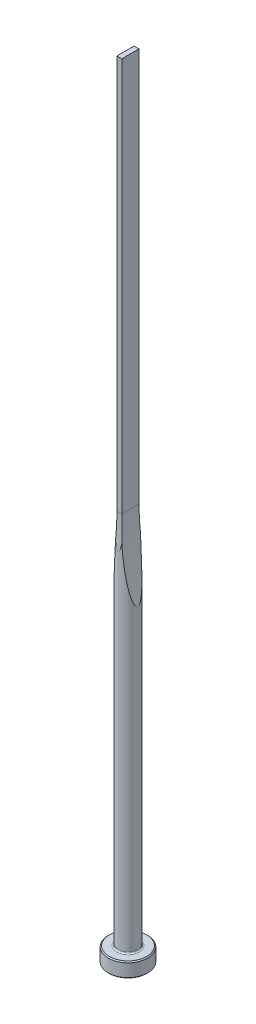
from build123d import *

# Parameters (mm, degrees)
CUT_EXTRUDE1_DEPTH = 5
CUT_EXTRUDE2_DEPTH = 5


with BuildPart() as part:
    # Sketch1 → Revolve1 (revolve)
    with BuildSketch(Plane.XY, mode=Mode.PRIVATE) as revolve1_sk:
        with BuildLine():
            Line((0, 0), (3.8, 0))
            Line((3.8, 0), (4, 0.2))
            Line((4, 0.2), (4, 2.8))
            Line((4, 2.8), (3.8, 3))
            Line((3.8, 3), (2.3, 3))
            ThreePointArc((2.3, 3), (2.087867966, 3.087867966), (2, 3.3))
            Line((2, 3.3), (2, 160))
            Line((2, 160), (0, 160))
            Line((0, 160), (0, 0))
        make_face()
    revolve(revolve1_sk.sketch.rotate(Axis((0, 160, 0), (0, -1, 0)), 180), axis=Axis((0, 160, 0), (0, -1, 0)))

    # Sketch2 → Cut-Extrude1 (cut, symmetric)
    with BuildSketch(Plane.XY):
        with BuildLine():
            Line((0.5, 160), (0.5, 80))
            ThreePointArc((0.5, 80), (0.875784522, 71.784161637), (2, 63.636931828))
            Line((2, 63.636931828), (2, 160))
            Line((2, 160), (0.5, 160))
        make_face()
        with BuildLine():
            Line((-0.5, 160), (-0.5, 80))
            ThreePointArc((-0.5, 80), (-0.875784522, 71.784161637), (-2, 63.636931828))
            Line((-2, 63.636931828), (-2, 160))
            Line((-2, 160), (-0.5, 160))
        make_face()
    extrude(amount=CUT_EXTRUDE1_DEPTH, both=True, mode=Mode.SUBTRACT)

    # Sketch3 → Cut-Extrude2 (cut, symmetric)
    with BuildSketch(Plane(origin=(0, 0, 0), x_dir=(0, 0, -1), z_dir=(1, 0, 0))):
        with BuildLine():
            Line((1.75, 160), (1.75, 80))
            ThreePointArc((1.75, 80), (1.812521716, 76.645898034), (2, 73.296456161))
            Line((2, 73.296456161), (2, 160))
            Line((2, 160), (1.75, 160))
        make_face()
        with BuildLine():
            Line((-1.75, 160), (-1.75, 80))
            ThreePointArc((-1.75, 80), (-1.812521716, 76.645898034), (-2, 73.296456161))
            Line((-2, 73.296456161), (-2, 160))
            Line((-2, 160), (-1.75, 160))
        make_face()
    extrude(amount=CUT_EXTRUDE2_DEPTH, both=True, mode=Mode.SUBTRACT)


solid = part.part
